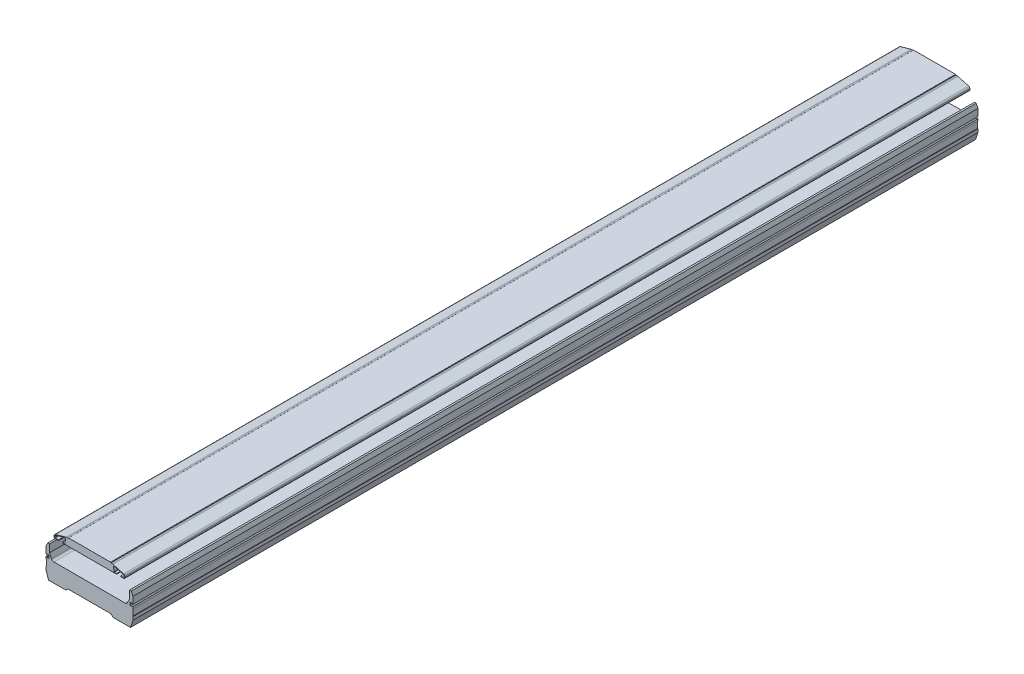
from build123d import *

# Parameters (mm, degrees)
EXTRUDE_1_DEPTH              = 1651
EXTRUDE_1_2_DEPTH            = 1651
HOLE_WIZARD_1_AT_2_COUNT     = 2
HOLE_WIZARD_1_AT_2_PITCH     = 140
HOLE_WIZARD_1_AT_3_COUNT     = 2
HOLE_WIZARD_1_AT_3_PITCH     = 244.131112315
HOLE_WIZARD_1_AT_4_COUNT     = 2
HOLE_WIZARD_1_AT_4_PITCH     = 423.792402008
HOLE_WIZARD_1_AT_5_COUNT     = 2
HOLE_WIZARD_1_AT_5_PITCH     = 616.11687203
HOLE_WIZARD_1_AT_6_COUNT     = 2
HOLE_WIZARD_1_AT_6_PITCH     = 812.15762017
HOLE_WIZARD_1_AT_7_COUNT     = 2
HOLE_WIZARD_1_AT_7_PITCH     = 1009.752444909
HOLE_WIZARD_1_AT_8_COUNT     = 2
HOLE_WIZARD_1_AT_8_PITCH     = 1406.982586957
HOLE_WIZARD_1_AT_9_COUNT     = 2
HOLE_WIZARD_1_AT_9_PITCH     = 1208.139064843
HOLE_WIZARD_1_AT_10_COUNT    = 2
HOLE_WIZARD_1_AT_10_PITCH    = 1200
HOLE_WIZARD_1_AT_11_COUNT    = 2
HOLE_WIZARD_1_AT_11_PITCH    = 1400
HOLE_WIZARD_1_AT_12_COUNT    = 2
HOLE_WIZARD_1_AT_12_PITCH    = 1000
HOLE_WIZARD_1_AT_13_COUNT    = 2
HOLE_WIZARD_1_AT_13_PITCH    = 800
HOLE_WIZARD_1_AT_14_COUNT    = 2
HOLE_WIZARD_1_AT_14_PITCH    = 600
HOLE_WIZARD_1_AT_15_COUNT    = 2
HOLE_WIZARD_1_AT_15_PITCH    = 400
HOLE_WIZARD_1_AT_16_COUNT    = 2
HOLE_WIZARD_1_AT_16_PITCH    = 200
HOLE_WIZARD_M8_1_AT_2_COUNT  = 2
HOLE_WIZARD_M8_1_AT_2_PITCH  = 140
HOLE_WIZARD_M8_1_AT_3_COUNT  = 2
HOLE_WIZARD_M8_1_AT_3_PITCH  = 244.131112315
HOLE_WIZARD_M8_1_AT_4_COUNT  = 2
HOLE_WIZARD_M8_1_AT_4_PITCH  = 423.792402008
HOLE_WIZARD_M8_1_AT_5_COUNT  = 2
HOLE_WIZARD_M8_1_AT_5_PITCH  = 616.11687203
HOLE_WIZARD_M8_1_AT_6_COUNT  = 2
HOLE_WIZARD_M8_1_AT_6_PITCH  = 812.15762017
HOLE_WIZARD_M8_1_AT_7_COUNT  = 2
HOLE_WIZARD_M8_1_AT_7_PITCH  = 1009.752444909
HOLE_WIZARD_M8_1_AT_8_COUNT  = 2
HOLE_WIZARD_M8_1_AT_8_PITCH  = 1208.139064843
HOLE_WIZARD_M8_1_AT_9_COUNT  = 2
HOLE_WIZARD_M8_1_AT_9_PITCH  = 1406.982586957
HOLE_WIZARD_M8_1_AT_10_COUNT = 2
HOLE_WIZARD_M8_1_AT_10_PITCH = 1400
HOLE_WIZARD_M8_1_AT_11_COUNT = 2
HOLE_WIZARD_M8_1_AT_11_PITCH = 1200
HOLE_WIZARD_M8_1_AT_12_COUNT = 2
HOLE_WIZARD_M8_1_AT_12_PITCH = 1000
HOLE_WIZARD_M8_1_AT_13_COUNT = 2
HOLE_WIZARD_M8_1_AT_13_PITCH = 800
HOLE_WIZARD_M8_1_AT_14_COUNT = 2
HOLE_WIZARD_M8_1_AT_14_PITCH = 600
HOLE_WIZARD_M8_1_AT_15_COUNT = 2
HOLE_WIZARD_M8_1_AT_15_PITCH = 400
HOLE_WIZARD_M8_1_AT_16_COUNT = 2
HOLE_WIZARD_M8_1_AT_16_PITCH = 200


with BuildPart() as part:
    # Sketch 1 → Extrude 1 (new body)
    with BuildSketch(Plane.XY):
        with BuildLine():
            Line((69.645372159, 32), (-69.645372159, 32))
            ThreePointArc((-69.645372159, 32), (-72.331870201, 32.783042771), (-74.176911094, 34.886908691))
            Line((-74.176911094, 34.886908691), (-78.1, 43.3))
            Line((-78.1, 43.3), (-78.1, 58.3))
            Line((-78.1, 58.3), (-81.5, 58.3))
            Line((-81.5, 58.3), (-85, 51.3))
            Line((-85, 51.3), (-85, 37.6))
            Line((-85, 37.6), (-83, 37.6))
            Line((-83, 37.6), (-83, 38.7))
            Line((-83, 38.7), (-80.2, 38.7))
            ThreePointArc((-80.2, 38.7), (-79.492893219, 38.407106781), (-79.2, 37.7))
            Line((-79.2, 37.7), (-79.2, 33.9))
            ThreePointArc((-79.2, 33.9), (-79.492893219, 33.192893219), (-80.2, 32.9))
            Line((-80.2, 32.9), (-83, 32.9))
            Line((-83, 32.9), (-83, 34))
            Line((-83, 34), (-85, 34))
            Line((-85, 34), (-85, 29.8))
            Line((-85, 29.8), (-84.5, 29.3))
            Line((-84.5, 29.3), (-84.5, 17.3))
            Line((-84.5, 17.3), (-85, 16.8))
            Line((-85, 16.8), (-85, 10.7))
            Line((-85, 10.7), (-80.1, -4))
            Line((-80.1, -4), (-46, -4))
            Line((-46, -4), (-42, 0))
            Line((-42, 0), (42, 0))
            Line((42, 0), (46, -4))
            Line((46, -4), (80.1, -4))
            Line((80.1, -4), (85, 10.7))
            Line((85, 10.7), (85, 16.8))
            Line((85, 16.8), (84.5, 17.3))
            Line((84.5, 17.3), (84.5, 29.3))
            Line((84.5, 29.3), (85, 29.8))
            Line((85, 29.8), (85, 34))
            Line((85, 34), (83, 34))
            Line((83, 34), (83, 32.9))
            Line((83, 32.9), (80.2, 32.9))
            ThreePointArc((80.2, 32.9), (79.492893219, 33.192893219), (79.2, 33.9))
            Line((79.2, 33.9), (79.2, 37.7))
            ThreePointArc((79.2, 37.7), (79.492893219, 38.407106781), (80.2, 38.7))
            Line((80.2, 38.7), (83, 38.7))
            Line((83, 38.7), (83, 37.6))
            Line((83, 37.6), (85, 37.6))
            Line((85, 37.6), (85, 51.3))
            Line((85, 51.3), (81.5, 58.3))
            Line((81.5, 58.3), (78.1, 58.3))
            Line((78.1, 58.3), (78.1, 43.3))
            Line((78.1, 43.3), (74.176911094, 34.886908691))
            ThreePointArc((74.176911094, 34.886908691), (72.331870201, 32.783042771), (69.645372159, 32))
        make_face()
    extrude(amount=EXTRUDE_1_DEPTH)

    # Sketch 3 → Hole Wizard 1 (revolve, cut)
    with BuildSketch(Plane(origin=(70, 58.3, 1577.5), x_dir=(0, 0, 1), z_dir=(1, 0, 0))):
        Polygon((0, 0), (0, 62.3), (4.5, 62.3), (4.5, 48.3), (7.5, 48.3), (7.5, 0), align=None)
    hole_wizard_1 = revolve(axis=Axis((70, 64.65, 1577.5), (0, -1, 0)), mode=Mode.SUBTRACT)

    # Hole Wizard 1 at 2: Hole Wizard 1 ×2
    with Locations(*[(-i * HOLE_WIZARD_1_AT_2_PITCH, 0, 0) for i in range(1, HOLE_WIZARD_1_AT_2_COUNT)]):
        add(hole_wizard_1, mode=Mode.SUBTRACT)

    # Hole Wizard 1 at 3: Hole Wizard 1 ×2
    with Locations(*[Vector(-0.573462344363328, 0, -0.8192319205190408) * (i * HOLE_WIZARD_1_AT_3_PITCH) for i in range(1, HOLE_WIZARD_1_AT_3_COUNT)]):
        add(hole_wizard_1, mode=Mode.SUBTRACT)

    # Hole Wizard 1 at 4: Hole Wizard 1 ×2
    with Locations(*[Vector(-0.33035042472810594, 0, -0.9438583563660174) * (i * HOLE_WIZARD_1_AT_4_PITCH) for i in range(1, HOLE_WIZARD_1_AT_4_COUNT)]):
        add(hole_wizard_1, mode=Mode.SUBTRACT)

    # Hole Wizard 1 at 5: Hole Wizard 1 ×2
    with Locations(*[Vector(-0.22722961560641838, 0, -0.9738412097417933) * (i * HOLE_WIZARD_1_AT_5_PITCH) for i in range(1, HOLE_WIZARD_1_AT_5_COUNT)]):
        add(hole_wizard_1, mode=Mode.SUBTRACT)

    # Hole Wizard 1 at 6: Hole Wizard 1 ×2
    with Locations(*[Vector(-0.1723803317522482, 0, -0.9850304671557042) * (i * HOLE_WIZARD_1_AT_6_PITCH) for i in range(1, HOLE_WIZARD_1_AT_6_COUNT)]):
        add(hole_wizard_1, mode=Mode.SUBTRACT)

    # Hole Wizard 1 at 7: Hole Wizard 1 ×2
    with Locations(*[Vector(-0.1386478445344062, 0, -0.9903417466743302) * (i * HOLE_WIZARD_1_AT_7_PITCH) for i in range(1, HOLE_WIZARD_1_AT_7_COUNT)]):
        add(hole_wizard_1, mode=Mode.SUBTRACT)

    # Hole Wizard 1 at 8: Hole Wizard 1 ×2
    with Locations(*[Vector(-0.09950371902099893, 0, -0.9950371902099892) * (i * HOLE_WIZARD_1_AT_8_PITCH) for i in range(1, HOLE_WIZARD_1_AT_8_COUNT)]):
        add(hole_wizard_1, mode=Mode.SUBTRACT)

    # Hole Wizard 1 at 9: Hole Wizard 1 ×2
    with Locations(*[Vector(-0.11588069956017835, 0, -0.993263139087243) * (i * HOLE_WIZARD_1_AT_9_PITCH) for i in range(1, HOLE_WIZARD_1_AT_9_COUNT)]):
        add(hole_wizard_1, mode=Mode.SUBTRACT)

    # Hole Wizard 1 at 10: Hole Wizard 1 ×2
    with Locations(*[(0, 0, -i * HOLE_WIZARD_1_AT_10_PITCH) for i in range(1, HOLE_WIZARD_1_AT_10_COUNT)]):
        add(hole_wizard_1, mode=Mode.SUBTRACT)

    # Hole Wizard 1 at 11: Hole Wizard 1 ×2
    with Locations(*[(0, 0, -i * HOLE_WIZARD_1_AT_11_PITCH) for i in range(1, HOLE_WIZARD_1_AT_11_COUNT)]):
        add(hole_wizard_1, mode=Mode.SUBTRACT)

    # Hole Wizard 1 at 12: Hole Wizard 1 ×2
    with Locations(*[(0, 0, -i * HOLE_WIZARD_1_AT_12_PITCH) for i in range(1, HOLE_WIZARD_1_AT_12_COUNT)]):
        add(hole_wizard_1, mode=Mode.SUBTRACT)

    # Hole Wizard 1 at 13: Hole Wizard 1 ×2
    with Locations(*[(0, 0, -i * HOLE_WIZARD_1_AT_13_PITCH) for i in range(1, HOLE_WIZARD_1_AT_13_COUNT)]):
        add(hole_wizard_1, mode=Mode.SUBTRACT)

    # Hole Wizard 1 at 14: Hole Wizard 1 ×2
    with Locations(*[(0, 0, -i * HOLE_WIZARD_1_AT_14_PITCH) for i in range(1, HOLE_WIZARD_1_AT_14_COUNT)]):
        add(hole_wizard_1, mode=Mode.SUBTRACT)

    # Hole Wizard 1 at 15: Hole Wizard 1 ×2
    with Locations(*[(0, 0, -i * HOLE_WIZARD_1_AT_15_PITCH) for i in range(1, HOLE_WIZARD_1_AT_15_COUNT)]):
        add(hole_wizard_1, mode=Mode.SUBTRACT)

    # Hole Wizard 1 at 16: Hole Wizard 1 ×2
    with Locations(*[(0, 0, -i * HOLE_WIZARD_1_AT_16_PITCH) for i in range(1, HOLE_WIZARD_1_AT_16_COUNT)]):
        add(hole_wizard_1, mode=Mode.SUBTRACT)

    # Sketch 5 → Hole Wizard M8 _1 (revolve, cut)
    with BuildSketch(Plane(origin=(-70, -4, 1592.5), x_dir=(0, 0, -1), z_dir=(1, 0, 0))):
        Polygon((0, 0), (0, 17.792926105), (3.4, 15.75), (3.4, 0), align=None)
    hole_wizard_m8_1 = revolve(axis=Axis((-70, -10.35, 1592.5), (0, 1, 0)), mode=Mode.SUBTRACT)

    # Hole Wizard M8 _1 at 2: Hole Wizard M8 _1 ×2
    with Locations(*[(i * HOLE_WIZARD_M8_1_AT_2_PITCH, 0, 0) for i in range(1, HOLE_WIZARD_M8_1_AT_2_COUNT)]):
        add(hole_wizard_m8_1, mode=Mode.SUBTRACT)

    # Hole Wizard M8 _1 at 3: Hole Wizard M8 _1 ×2
    with Locations(*[Vector(0.573462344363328, -2.3102065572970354e-14, -0.8192319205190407) * (i * HOLE_WIZARD_M8_1_AT_3_PITCH) for i in range(1, HOLE_WIZARD_M8_1_AT_3_COUNT)]):
        add(hole_wizard_m8_1, mode=Mode.SUBTRACT)

    # Hole Wizard M8 _1 at 4: Hole Wizard M8 _1 ×2
    with Locations(*[Vector(0.33035042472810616, -1.3308244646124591e-14, -0.9438583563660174) * (i * HOLE_WIZARD_M8_1_AT_4_PITCH) for i in range(1, HOLE_WIZARD_M8_1_AT_4_COUNT)]):
        add(hole_wizard_m8_1, mode=Mode.SUBTRACT)

    # Hole Wizard M8 _1 at 5: Hole Wizard M8 _1 ×2
    with Locations(*[Vector(0.22722961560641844, -9.153998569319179e-15, -0.9738412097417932) * (i * HOLE_WIZARD_M8_1_AT_5_PITCH) for i in range(1, HOLE_WIZARD_M8_1_AT_5_COUNT)]):
        add(hole_wizard_m8_1, mode=Mode.SUBTRACT)

    # Hole Wizard M8 _1 at 6: Hole Wizard M8 _1 ×2
    with Locations(*[Vector(0.17238033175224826, -6.9443822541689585e-15, -0.9850304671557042) * (i * HOLE_WIZARD_M8_1_AT_6_PITCH) for i in range(1, HOLE_WIZARD_M8_1_AT_6_COUNT)]):
        add(hole_wizard_m8_1, mode=Mode.SUBTRACT)

    # Hole Wizard M8 _1 at 7: Hole Wizard M8 _1 ×2
    with Locations(*[Vector(0.13864784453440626, -5.585461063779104e-15, -0.9903417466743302) * (i * HOLE_WIZARD_M8_1_AT_7_PITCH) for i in range(1, HOLE_WIZARD_M8_1_AT_7_COUNT)]):
        add(hole_wizard_m8_1, mode=Mode.SUBTRACT)

    # Hole Wizard M8 _1 at 8: Hole Wizard M8 _1 ×2
    with Locations(*[Vector(0.11588069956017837, -4.668281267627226e-15, -0.993263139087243) * (i * HOLE_WIZARD_M8_1_AT_8_PITCH) for i in range(1, HOLE_WIZARD_M8_1_AT_8_COUNT)]):
        add(hole_wizard_m8_1, mode=Mode.SUBTRACT)

    # Hole Wizard M8 _1 at 9: Hole Wizard M8 _1 ×2
    with Locations(*[Vector(0.09950371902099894, -4.008530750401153e-15, -0.9950371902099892) * (i * HOLE_WIZARD_M8_1_AT_9_PITCH) for i in range(1, HOLE_WIZARD_M8_1_AT_9_COUNT)]):
        add(hole_wizard_m8_1, mode=Mode.SUBTRACT)

    # Hole Wizard M8 _1 at 10: Hole Wizard M8 _1 ×2
    with Locations(*[(0, 0, -i * HOLE_WIZARD_M8_1_AT_10_PITCH) for i in range(1, HOLE_WIZARD_M8_1_AT_10_COUNT)]):
        add(hole_wizard_m8_1, mode=Mode.SUBTRACT)

    # Hole Wizard M8 _1 at 11: Hole Wizard M8 _1 ×2
    with Locations(*[(0, 0, -i * HOLE_WIZARD_M8_1_AT_11_PITCH) for i in range(1, HOLE_WIZARD_M8_1_AT_11_COUNT)]):
        add(hole_wizard_m8_1, mode=Mode.SUBTRACT)

    # Hole Wizard M8 _1 at 12: Hole Wizard M8 _1 ×2
    with Locations(*[(0, 0, -i * HOLE_WIZARD_M8_1_AT_12_PITCH) for i in range(1, HOLE_WIZARD_M8_1_AT_12_COUNT)]):
        add(hole_wizard_m8_1, mode=Mode.SUBTRACT)

    # Hole Wizard M8 _1 at 13: Hole Wizard M8 _1 ×2
    with Locations(*[(0, 0, -i * HOLE_WIZARD_M8_1_AT_13_PITCH) for i in range(1, HOLE_WIZARD_M8_1_AT_13_COUNT)]):
        add(hole_wizard_m8_1, mode=Mode.SUBTRACT)

    # Hole Wizard M8 _1 at 14: Hole Wizard M8 _1 ×2
    with Locations(*[(0, 0, -i * HOLE_WIZARD_M8_1_AT_14_PITCH) for i in range(1, HOLE_WIZARD_M8_1_AT_14_COUNT)]):
        add(hole_wizard_m8_1, mode=Mode.SUBTRACT)

    # Hole Wizard M8 _1 at 15: Hole Wizard M8 _1 ×2
    with Locations(*[(0, 0, -i * HOLE_WIZARD_M8_1_AT_15_PITCH) for i in range(1, HOLE_WIZARD_M8_1_AT_15_COUNT)]):
        add(hole_wizard_m8_1, mode=Mode.SUBTRACT)

    # Hole Wizard M8 _1 at 16: Hole Wizard M8 _1 ×2
    with Locations(*[(0, 0, -i * HOLE_WIZARD_M8_1_AT_16_PITCH) for i in range(1, HOLE_WIZARD_M8_1_AT_16_COUNT)]):
        add(hole_wizard_m8_1, mode=Mode.SUBTRACT)


with BuildPart() as body_2:
    # Sketch 1 → Extrude 1 2 (new body)
    with BuildSketch(Plane.XY):
        with BuildLine():
            Line((41, 87), (-41, 87))
            ThreePointArc((-41, 87), (-41.353553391, 86.853553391), (-41.5, 86.5))
            ThreePointArc((-41.5, 86.5), (-41.646446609, 86.146446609), (-42, 86))
            Line((-42, 86), (-44.425413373, 86))
            ThreePointArc((-44.425413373, 86), (-45.099668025, 85.954329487), (-45.761605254, 85.818152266))
            Line((-45.761605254, 85.818152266), (-66.655162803, 80.023855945))
            ThreePointArc((-66.655162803, 80.023855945), (-68.347206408, 78.877179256), (-69, 76.940238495))
            Line((-69, 76.940238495), (-69, 74.5))
            ThreePointArc((-69, 74.5), (-68.414213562, 73.085786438), (-67, 72.5))
            Line((-67, 72.5), (-61, 72.5))
            Line((-61, 72.5), (-61, 73.7))
            Line((-61, 73.7), (-67, 73.7))
            ThreePointArc((-67, 73.7), (-67.565685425, 73.934314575), (-67.8, 74.5))
            Line((-67.8, 74.5), (-67.8, 76.940238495))
            ThreePointArc((-67.8, 76.940238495), (-67.392004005, 78.150826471), (-66.334476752, 78.867499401))
            Line((-66.334476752, 78.867499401), (-49.610647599, 83.505427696))
            ThreePointArc((-49.610647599, 83.505427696), (-47.555281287, 83.011977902), (-46.884572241, 81.007439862))
            Line((-46.884572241, 81.007439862), (-48.117675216, 74.35421158))
            ThreePointArc((-48.117675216, 74.35421158), (-48.392727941, 73.884926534), (-48.904279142, 73.7))
            Line((-48.904279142, 73.7), (-53, 73.7))
            Line((-53, 73.7), (-53, 72.5))
            Line((-53, 72.5), (53, 72.5))
            Line((53, 72.5), (53, 73.7))
            Line((53, 73.7), (48.904279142, 73.7))
            ThreePointArc((48.904279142, 73.7), (48.392727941, 73.884926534), (48.117675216, 74.35421158))
            Line((48.117675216, 74.35421158), (46.884572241, 81.007439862))
            ThreePointArc((46.884572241, 81.007439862), (47.555281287, 83.011977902), (49.610647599, 83.505427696))
            Line((49.610647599, 83.505427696), (66.334476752, 78.867499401))
            ThreePointArc((66.334476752, 78.867499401), (67.392004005, 78.150826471), (67.8, 76.940238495))
            Line((67.8, 76.940238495), (67.8, 74.5))
            ThreePointArc((67.8, 74.5), (67.565685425, 73.934314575), (67, 73.7))
            Line((67, 73.7), (61, 73.7))
            Line((61, 73.7), (61, 72.5))
            Line((61, 72.5), (67, 72.5))
            ThreePointArc((67, 72.5), (68.414213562, 73.085786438), (69, 74.5))
            Line((69, 74.5), (69, 76.940238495))
            ThreePointArc((69, 76.940238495), (68.347206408, 78.877179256), (66.655162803, 80.023855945))
            Line((66.655162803, 80.023855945), (45.761605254, 85.818152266))
            ThreePointArc((45.761605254, 85.818152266), (45.099668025, 85.954329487), (44.425413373, 86))
            Line((44.425413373, 86), (42, 86))
            ThreePointArc((42, 86), (41.646446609, 86.146446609), (41.5, 86.5))
            ThreePointArc((41.5, 86.5), (41.353553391, 86.853553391), (41, 87))
        make_face()
    extrude(amount=EXTRUDE_1_2_DEPTH)


solid = Compound([part.part, body_2.part])
